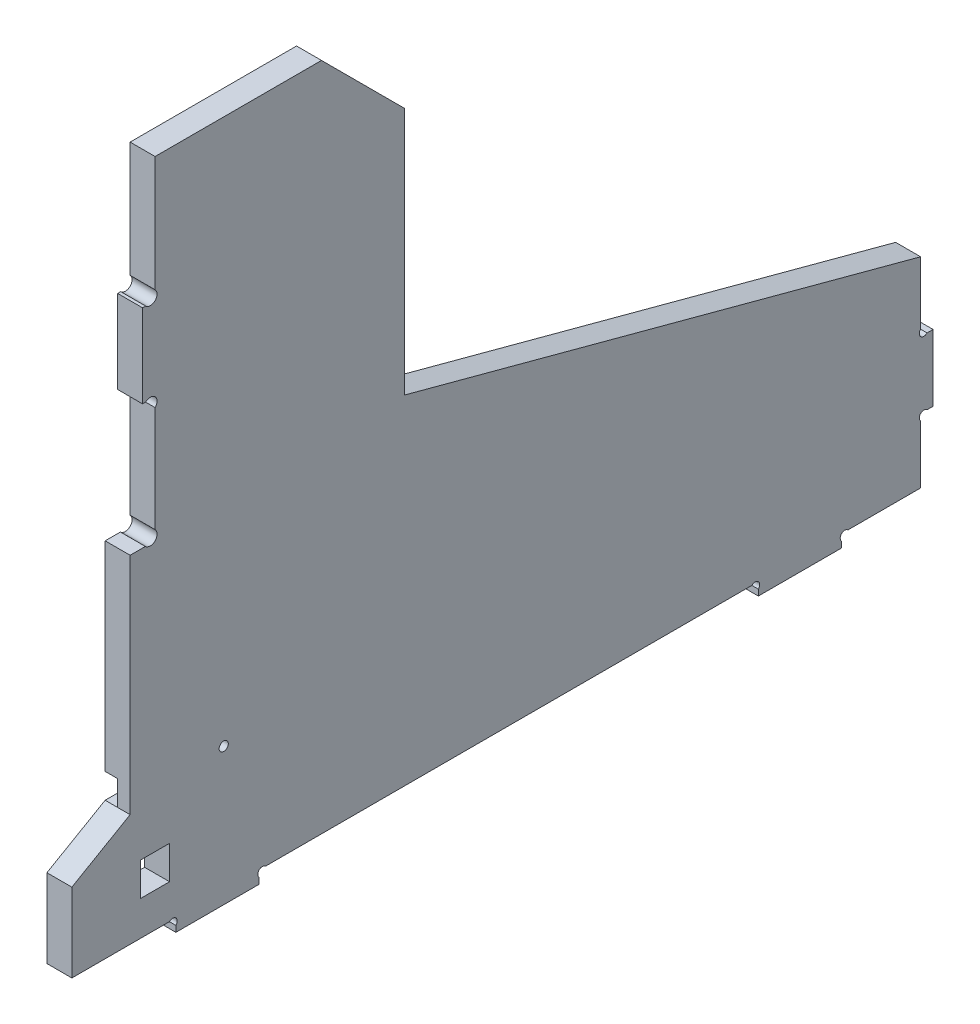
from build123d import *

# Parameters (mm, degrees)
ESQUISSE1_R             = 1.1
ESQUISSE1_W             = 7
ESQUISSE1_H             = 8
BOSS_EXTRU_1_DEPTH      = 6
ENL_V_MAT_EXTRU_1_DEPTH = 3


with BuildPart() as part:
    # Esquisse1 → Boss.-Extru.1 (new body)
    with BuildSketch(Plane(origin=(0, 0, 0), x_dir=(0, 0, -1), z_dir=(1, 0, 0))):
        with BuildLine():
            Line((20, 164), (20, 136.2627417))
            ThreePointArc((20, 136.2627417), (20, 134), (17.7372583, 134))
            Line((17.7372583, 134), (17, 134))
            Line((17, 134), (17, 114))
            Line((17, 114), (17.7372583, 114))
            ThreePointArc((17.7372583, 114), (20, 114), (20, 111.7372583))
            Line((20, 111.7372583), (20, 86.333452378))
            ThreePointArc((20, 86.333452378), (20, 84), (17.666547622, 84))
            Line((17.666547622, 84), (14, 84))
            Line((14, 84), (14, 30))
            Line((14, 30), (0, 21.917096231))
            Line((0, 21.917096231), (0, 3))
            Line((0, 3), (23.444365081, 3))
            ThreePointArc((23.444365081, 3), (25, 3), (25, 1.444365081))
            Line((25, 1.444365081), (25, 0))
            Line((25, 0), (45, 0))
            Line((45, 0), (45, 1.444365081))
            ThreePointArc((45, 1.444365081), (45, 3), (46.555634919, 3))
            Line((46.555634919, 3), (163.444365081, 3))
            ThreePointArc((163.444365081, 3), (165, 3), (165, 1.444365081))
            Line((165, 1.444365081), (165, 0))
            Line((165, 0), (185, 0))
            Line((185, 0), (185, 1.444365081))
            ThreePointArc((185, 1.444365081), (185, 3), (186.555634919, 3))
            Line((186.555634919, 3), (204, 3))
            Line((204, 3), (204, 16.944365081))
            ThreePointArc((204, 16.944365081), (204, 18.5), (205.555634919, 18.5))
            Line((205.555634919, 18.5), (207, 18.5))
            Line((207, 18.5), (207, 34.5))
            Line((207, 34.5), (205.555634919, 34.5))
            ThreePointArc((205.555634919, 34.5), (204, 34.5), (204, 36.055634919))
            Line((204, 36.055634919), (204, 51.13))
            Line((204, 51.13), (80, 84.355699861))
            Line((80, 84.355699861), (80, 144))
            Line((80, 144), (60, 164))
            Line((60, 164), (20, 164))
        make_face()
        with Locations((36.5, 33)):
            Circle(ESQUISSE1_R, mode=Mode.SUBTRACT)
        with Locations((19.98, 15.3)):
            Rectangle(ESQUISSE1_W, ESQUISSE1_H, mode=Mode.SUBTRACT)
    extrude(amount=BOSS_EXTRU_1_DEPTH)

    # Esquisse2 → Enl_v. mat.-Extru.1 (cut)
    with BuildSketch(Plane(origin=(0, 0, 0), x_dir=(0, 0, -1), z_dir=(1, 0, 0))):
        with BuildLine():
            Line((59, 33.878679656), (59, 32.121320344))
            ThreePointArc((59, 32.121320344), (59, 30), (56.878679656, 30))
            Line((56.878679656, 30), (14, 30))
            Line((14, 30), (14, 36))
            Line((14, 36), (56.878679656, 36))
            ThreePointArc((56.878679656, 36), (59, 36), (59, 33.878679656))
        make_face()
    extrude(amount=ENL_V_MAT_EXTRU_1_DEPTH, mode=Mode.SUBTRACT)


solid = part.part
